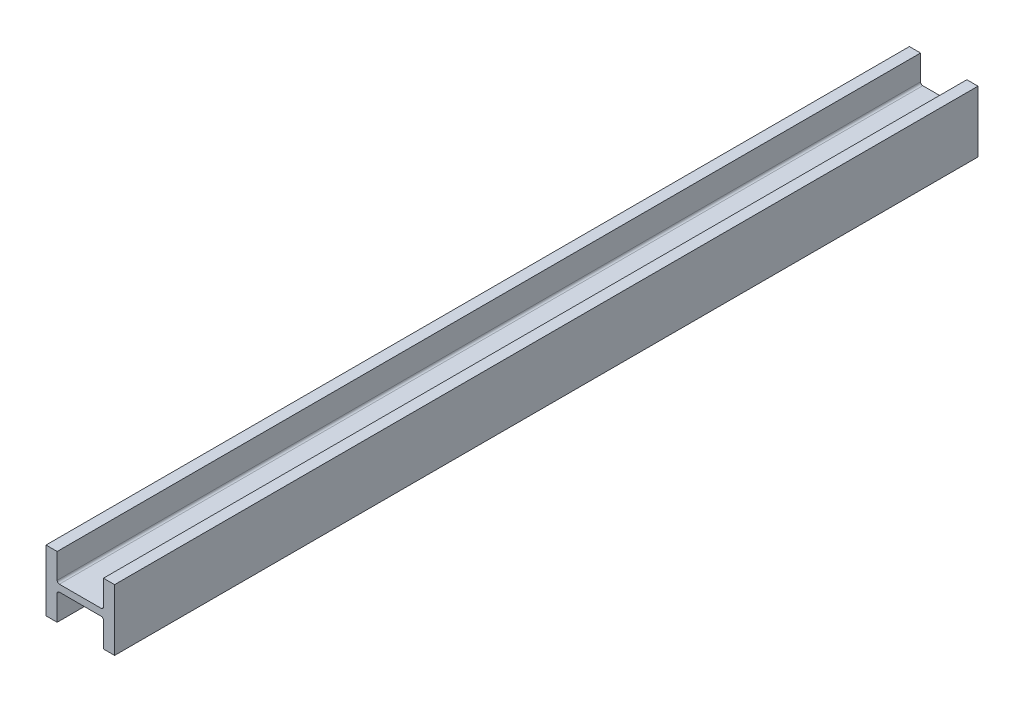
ISO-10303-21;
HEADER;
FILE_DESCRIPTION(('STEP AP214'),'2;1');
FILE_NAME('part.step','',(''),(''),'','','');
FILE_SCHEMA(('AUTOMOTIVE_DESIGN { 1 0 10303 214 1 1 1 1 }'));
ENDSEC;
DATA;
#1=APPLICATION_CONTEXT('core data for automotive mechanical design processes');
#2=APPLICATION_PROTOCOL_DEFINITION('international standard','automotive_design',2000,#1);
#3=PRODUCT_CONTEXT('',#1,'mechanical');
#4=PRODUCT('Part','Part','',(#3));
#5=PRODUCT_RELATED_PRODUCT_CATEGORY('part','',(#4));
#6=PRODUCT_DEFINITION_FORMATION('','',#4);
#7=PRODUCT_DEFINITION_CONTEXT('part definition',#1,'design');
#8=PRODUCT_DEFINITION('design','',#6,#7);
#9=PRODUCT_DEFINITION_SHAPE('','',#8);
#10=(LENGTH_UNIT() NAMED_UNIT(*) SI_UNIT(.MILLI.,.METRE.));
#11=(NAMED_UNIT(*) PLANE_ANGLE_UNIT() SI_UNIT($,.RADIAN.));
#12=(NAMED_UNIT(*) SI_UNIT($,.STERADIAN.) SOLID_ANGLE_UNIT());
#13=UNCERTAINTY_MEASURE_WITH_UNIT(LENGTH_MEASURE(1.E-05),#10,'distance_accuracy_value','');
#14=(GEOMETRIC_REPRESENTATION_CONTEXT(3) GLOBAL_UNCERTAINTY_ASSIGNED_CONTEXT((#13)) GLOBAL_UNIT_ASSIGNED_CONTEXT((#10,
#11,#12)) REPRESENTATION_CONTEXT('',''));
#15=CARTESIAN_POINT('',(0.,0.,0.));
#16=DIRECTION('',(0.,0.,1.));
#17=DIRECTION('',(1.,0.,0.));
#18=AXIS2_PLACEMENT_3D('',#15,#16,#17);
#19=CARTESIAN_POINT('',(237.109,212.0265,2984.5));
#20=DIRECTION('',(-1.,0.,0.));
#21=DIRECTION('',(0.,0.,1.));
#22=AXIS2_PLACEMENT_3D('',#19,#20,#21);
#23=PLANE('',#22);
#24=DIRECTION('',(0.,1.,0.));
#25=VECTOR('',#24,1.);
#26=CARTESIAN_POINT('',(237.109,212.0265,-2984.5));
#27=LINE('',#26,#25);
#28=CARTESIAN_POINT('',(237.109,-212.0265,-2984.5));
#29=VERTEX_POINT('',#28);
#30=CARTESIAN_POINT('',(237.109,212.0265,-2984.5));
#31=VERTEX_POINT('',#30);
#32=EDGE_CURVE('E192',#29,#31,#27,.T.);
#33=ORIENTED_EDGE('',*,*,#32,.T.);
#34=DIRECTION('',(0.,0.,-1.));
#35=VECTOR('',#34,1.);
#36=CARTESIAN_POINT('',(237.109,212.0265,2984.5));
#37=LINE('',#36,#35);
#38=CARTESIAN_POINT('',(237.109,212.0265,2984.5));
#39=VERTEX_POINT('',#38);
#40=EDGE_CURVE('E11',#39,#31,#37,.T.);
#41=ORIENTED_EDGE('',*,*,#40,.F.);
#42=DIRECTION('',(0.,1.,0.));
#43=VECTOR('',#42,1.);
#44=CARTESIAN_POINT('',(237.109,212.0265,2984.5));
#45=LINE('',#44,#43);
#46=CARTESIAN_POINT('',(237.109,-212.0265,2984.5));
#47=VERTEX_POINT('',#46);
#48=EDGE_CURVE('E238',#47,#39,#45,.T.);
#49=ORIENTED_EDGE('',*,*,#48,.F.);
#50=DIRECTION('',(0.,0.,-1.));
#51=VECTOR('',#50,1.);
#52=CARTESIAN_POINT('',(237.109,-212.0265,2984.5));
#53=LINE('',#52,#51);
#54=EDGE_CURVE('E190',#47,#29,#53,.T.);
#55=ORIENTED_EDGE('',*,*,#54,.T.);
#56=EDGE_LOOP('',(#33,#41,#49,#55));
#57=FACE_BOUND('',#56,.T.);
#58=ADVANCED_FACE('F44',(#57),#23,.F.);
#59=CARTESIAN_POINT('',(160.02,212.0265,2984.5));
#60=DIRECTION('',(0.,-1.,0.));
#61=DIRECTION('',(1.,0.,0.));
#62=AXIS2_PLACEMENT_3D('',#59,#60,#61);
#63=PLANE('',#62);
#64=DIRECTION('',(-1.,0.,0.));
#65=VECTOR('',#64,1.);
#66=CARTESIAN_POINT('',(160.02,212.0265,-2984.5));
#67=LINE('',#66,#65);
#68=CARTESIAN_POINT('',(160.02,212.0265,-2984.5));
#69=VERTEX_POINT('',#68);
#70=EDGE_CURVE('E196',#31,#69,#67,.T.);
#71=ORIENTED_EDGE('',*,*,#70,.T.);
#72=DIRECTION('',(0.,0.,-1.));
#73=VECTOR('',#72,1.);
#74=CARTESIAN_POINT('',(160.02,212.0265,2984.5));
#75=LINE('',#74,#73);
#76=CARTESIAN_POINT('',(160.02,212.0265,2984.5));
#77=VERTEX_POINT('',#76);
#78=EDGE_CURVE('E53',#77,#69,#75,.T.);
#79=ORIENTED_EDGE('',*,*,#78,.F.);
#80=DIRECTION('',(-1.,0.,0.));
#81=VECTOR('',#80,1.);
#82=CARTESIAN_POINT('',(160.02,212.0265,2984.5));
#83=LINE('',#82,#81);
#84=EDGE_CURVE('E129',#39,#77,#83,.T.);
#85=ORIENTED_EDGE('',*,*,#84,.F.);
#86=ORIENTED_EDGE('',*,*,#40,.T.);
#87=EDGE_LOOP('',(#71,#79,#85,#86));
#88=FACE_BOUND('',#87,.T.);
#89=ADVANCED_FACE('F362',(#88),#63,.F.);
#90=CARTESIAN_POINT('',(160.02,39.0525000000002,2984.5));
#91=DIRECTION('',(1.,0.,0.));
#92=DIRECTION('',(0.,0.,-1.));
#93=AXIS2_PLACEMENT_3D('',#90,#91,#92);
#94=PLANE('',#93);
#95=DIRECTION('',(0.,-1.,0.));
#96=VECTOR('',#95,1.);
#97=CARTESIAN_POINT('',(160.02,39.0525000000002,-2984.5));
#98=LINE('',#97,#96);
#99=CARTESIAN_POINT('',(160.02,39.0525000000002,-2984.5));
#100=VERTEX_POINT('',#99);
#101=EDGE_CURVE('E203',#69,#100,#98,.T.);
#102=ORIENTED_EDGE('',*,*,#101,.T.);
#103=DIRECTION('',(0.,0.,-1.));
#104=VECTOR('',#103,1.);
#105=CARTESIAN_POINT('',(160.02,39.0525000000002,2984.5));
#106=LINE('',#105,#104);
#107=CARTESIAN_POINT('',(160.02,39.0525000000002,2984.5));
#108=VERTEX_POINT('',#107);
#109=EDGE_CURVE('E284',#108,#100,#106,.T.);
#110=ORIENTED_EDGE('',*,*,#109,.F.);
#111=DIRECTION('',(0.,-1.,0.));
#112=VECTOR('',#111,1.);
#113=CARTESIAN_POINT('',(160.02,39.0525000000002,2984.5));
#114=LINE('',#113,#112);
#115=EDGE_CURVE('E291',#77,#108,#114,.T.);
#116=ORIENTED_EDGE('',*,*,#115,.F.);
#117=ORIENTED_EDGE('',*,*,#78,.T.);
#118=EDGE_LOOP('',(#102,#110,#116,#117));
#119=FACE_BOUND('',#118,.T.);
#120=ADVANCED_FACE('F292',(#119),#94,.F.);
#121=CARTESIAN_POINT('',(144.78,39.0525000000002,2984.5));
#122=DIRECTION('',(0.,0.,-1.));
#123=DIRECTION('',(-1.,0.,0.));
#124=AXIS2_PLACEMENT_3D('',#121,#122,#123);
#125=CYLINDRICAL_SURFACE('',#124,15.24);
#126=CARTESIAN_POINT('',(144.78,39.0525000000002,-2984.5));
#127=DIRECTION('',(0.,0.,-1.));
#128=DIRECTION('',(1.,0.,0.));
#129=AXIS2_PLACEMENT_3D('',#126,#127,#128);
#130=CIRCLE('',#129,15.24);
#131=CARTESIAN_POINT('',(144.78,23.8125000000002,-2984.5));
#132=VERTEX_POINT('',#131);
#133=EDGE_CURVE('E204',#100,#132,#130,.T.);
#134=ORIENTED_EDGE('',*,*,#133,.T.);
#135=DIRECTION('',(0.,0.,-1.));
#136=VECTOR('',#135,1.);
#137=CARTESIAN_POINT('',(144.78,23.8125000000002,2984.5));
#138=LINE('',#137,#136);
#139=CARTESIAN_POINT('',(144.78,23.8125000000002,2984.5));
#140=VERTEX_POINT('',#139);
#141=EDGE_CURVE('E276',#140,#132,#138,.T.);
#142=ORIENTED_EDGE('',*,*,#141,.F.);
#143=CARTESIAN_POINT('',(144.78,39.0525000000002,2984.5));
#144=DIRECTION('',(0.,0.,-1.));
#145=DIRECTION('',(1.,0.,0.));
#146=AXIS2_PLACEMENT_3D('',#143,#144,#145);
#147=CIRCLE('',#146,15.24);
#148=EDGE_CURVE('E315',#108,#140,#147,.T.);
#149=ORIENTED_EDGE('',*,*,#148,.F.);
#150=ORIENTED_EDGE('',*,*,#109,.T.);
#151=EDGE_LOOP('',(#134,#142,#149,#150));
#152=FACE_BOUND('',#151,.T.);
#153=ADVANCED_FACE('F305',(#152),#125,.F.);
#154=CARTESIAN_POINT('',(-144.78,23.8125000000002,2984.5));
#155=DIRECTION('',(0.,-1.,0.));
#156=DIRECTION('',(1.,0.,0.));
#157=AXIS2_PLACEMENT_3D('',#154,#155,#156);
#158=PLANE('',#157);
#159=DIRECTION('',(-1.,0.,0.));
#160=VECTOR('',#159,1.);
#161=CARTESIAN_POINT('',(-144.78,23.8125000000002,-2984.5));
#162=LINE('',#161,#160);
#163=CARTESIAN_POINT('',(-144.78,23.8125000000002,-2984.5));
#164=VERTEX_POINT('',#163);
#165=EDGE_CURVE('E210',#132,#164,#162,.T.);
#166=ORIENTED_EDGE('',*,*,#165,.T.);
#167=DIRECTION('',(0.,0.,-1.));
#168=VECTOR('',#167,1.);
#169=CARTESIAN_POINT('',(-144.78,23.8125000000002,2984.5));
#170=LINE('',#169,#168);
#171=CARTESIAN_POINT('',(-144.78,23.8125000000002,2984.5));
#172=VERTEX_POINT('',#171);
#173=EDGE_CURVE('E274',#172,#164,#170,.T.);
#174=ORIENTED_EDGE('',*,*,#173,.F.);
#175=DIRECTION('',(-1.,0.,0.));
#176=VECTOR('',#175,1.);
#177=CARTESIAN_POINT('',(-144.78,23.8125000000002,2984.5));
#178=LINE('',#177,#176);
#179=EDGE_CURVE('E306',#140,#172,#178,.T.);
#180=ORIENTED_EDGE('',*,*,#179,.F.);
#181=ORIENTED_EDGE('',*,*,#141,.T.);
#182=EDGE_LOOP('',(#166,#174,#180,#181));
#183=FACE_BOUND('',#182,.T.);
#184=ADVANCED_FACE('F308',(#183),#158,.F.);
#185=CARTESIAN_POINT('',(-144.78,39.0525000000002,2984.5));
#186=DIRECTION('',(0.,0.,-1.));
#187=DIRECTION('',(-1.,0.,0.));
#188=AXIS2_PLACEMENT_3D('',#185,#186,#187);
#189=CYLINDRICAL_SURFACE('',#188,15.24);
#190=CARTESIAN_POINT('',(-144.78,39.0525000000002,-2984.5));
#191=DIRECTION('',(0.,0.,-1.));
#192=DIRECTION('',(1.,0.,0.));
#193=AXIS2_PLACEMENT_3D('',#190,#191,#192);
#194=CIRCLE('',#193,15.24);
#195=CARTESIAN_POINT('',(-160.02,39.0525000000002,-2984.5));
#196=VERTEX_POINT('',#195);
#197=EDGE_CURVE('E209',#164,#196,#194,.T.);
#198=ORIENTED_EDGE('',*,*,#197,.T.);
#199=DIRECTION('',(0.,0.,-1.));
#200=VECTOR('',#199,1.);
#201=CARTESIAN_POINT('',(-160.02,39.0525000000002,2984.5));
#202=LINE('',#201,#200);
#203=CARTESIAN_POINT('',(-160.02,39.0525000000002,2984.5));
#204=VERTEX_POINT('',#203);
#205=EDGE_CURVE('E271',#204,#196,#202,.T.);
#206=ORIENTED_EDGE('',*,*,#205,.F.);
#207=CARTESIAN_POINT('',(-144.78,39.0525000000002,2984.5));
#208=DIRECTION('',(0.,0.,-1.));
#209=DIRECTION('',(1.,0.,0.));
#210=AXIS2_PLACEMENT_3D('',#207,#208,#209);
#211=CIRCLE('',#210,15.24);
#212=EDGE_CURVE('E313',#172,#204,#211,.T.);
#213=ORIENTED_EDGE('',*,*,#212,.F.);
#214=ORIENTED_EDGE('',*,*,#173,.T.);
#215=EDGE_LOOP('',(#198,#206,#213,#214));
#216=FACE_BOUND('',#215,.T.);
#217=ADVANCED_FACE('F374',(#216),#189,.F.);
#218=CARTESIAN_POINT('',(-160.02,212.0265,2984.5));
#219=DIRECTION('',(-1.,0.,0.));
#220=DIRECTION('',(0.,0.,1.));
#221=AXIS2_PLACEMENT_3D('',#218,#219,#220);
#222=PLANE('',#221);
#223=DIRECTION('',(0.,1.,0.));
#224=VECTOR('',#223,1.);
#225=CARTESIAN_POINT('',(-160.02,212.0265,-2984.5));
#226=LINE('',#225,#224);
#227=CARTESIAN_POINT('',(-160.02,212.0265,-2984.5));
#228=VERTEX_POINT('',#227);
#229=EDGE_CURVE('E213',#196,#228,#226,.T.);
#230=ORIENTED_EDGE('',*,*,#229,.T.);
#231=DIRECTION('',(0.,0.,-1.));
#232=VECTOR('',#231,1.);
#233=CARTESIAN_POINT('',(-160.02,212.0265,2984.5));
#234=LINE('',#233,#232);
#235=CARTESIAN_POINT('',(-160.02,212.0265,2984.5));
#236=VERTEX_POINT('',#235);
#237=EDGE_CURVE('E270',#236,#228,#234,.T.);
#238=ORIENTED_EDGE('',*,*,#237,.F.);
#239=DIRECTION('',(0.,1.,0.));
#240=VECTOR('',#239,1.);
#241=CARTESIAN_POINT('',(-160.02,212.0265,2984.5));
#242=LINE('',#241,#240);
#243=EDGE_CURVE('E316',#204,#236,#242,.T.);
#244=ORIENTED_EDGE('',*,*,#243,.F.);
#245=ORIENTED_EDGE('',*,*,#205,.T.);
#246=EDGE_LOOP('',(#230,#238,#244,#245));
#247=FACE_BOUND('',#246,.T.);
#248=ADVANCED_FACE('F378',(#247),#222,.F.);
#249=CARTESIAN_POINT('',(-237.109,212.0265,2984.5));
#250=DIRECTION('',(0.,-1.,0.));
#251=DIRECTION('',(0.,0.,-1.));
#252=AXIS2_PLACEMENT_3D('',#249,#250,#251);
#253=PLANE('',#252);
#254=DIRECTION('',(-1.,0.,0.));
#255=VECTOR('',#254,1.);
#256=CARTESIAN_POINT('',(-237.109,212.0265,-2984.5));
#257=LINE('',#256,#255);
#258=CARTESIAN_POINT('',(-237.109,212.0265,-2984.5));
#259=VERTEX_POINT('',#258);
#260=EDGE_CURVE('E216',#228,#259,#257,.T.);
#261=ORIENTED_EDGE('',*,*,#260,.T.);
#262=DIRECTION('',(0.,0.,-1.));
#263=VECTOR('',#262,1.);
#264=CARTESIAN_POINT('',(-237.109,212.0265,2984.5));
#265=LINE('',#264,#263);
#266=CARTESIAN_POINT('',(-237.109,212.0265,2984.5));
#267=VERTEX_POINT('',#266);
#268=EDGE_CURVE('E263',#267,#259,#265,.T.);
#269=ORIENTED_EDGE('',*,*,#268,.F.);
#270=DIRECTION('',(-1.,0.,0.));
#271=VECTOR('',#270,1.);
#272=CARTESIAN_POINT('',(-237.109,212.0265,2984.5));
#273=LINE('',#272,#271);
#274=EDGE_CURVE('E323',#236,#267,#273,.T.);
#275=ORIENTED_EDGE('',*,*,#274,.F.);
#276=ORIENTED_EDGE('',*,*,#237,.T.);
#277=EDGE_LOOP('',(#261,#269,#275,#276));
#278=FACE_BOUND('',#277,.T.);
#279=ADVANCED_FACE('F385',(#278),#253,.F.);
#280=CARTESIAN_POINT('',(-237.109,-212.0265,2984.5));
#281=DIRECTION('',(1.,0.,0.));
#282=DIRECTION('',(0.,0.,-1.));
#283=AXIS2_PLACEMENT_3D('',#280,#281,#282);
#284=PLANE('',#283);
#285=DIRECTION('',(0.,-1.,0.));
#286=VECTOR('',#285,1.);
#287=CARTESIAN_POINT('',(-237.109,-212.0265,-2984.5));
#288=LINE('',#287,#286);
#289=CARTESIAN_POINT('',(-237.109,-212.0265,-2984.5));
#290=VERTEX_POINT('',#289);
#291=EDGE_CURVE('E218',#259,#290,#288,.T.);
#292=ORIENTED_EDGE('',*,*,#291,.T.);
#293=DIRECTION('',(0.,0.,-1.));
#294=VECTOR('',#293,1.);
#295=CARTESIAN_POINT('',(-237.109,-212.0265,2984.5));
#296=LINE('',#295,#294);
#297=CARTESIAN_POINT('',(-237.109,-212.0265,2984.5));
#298=VERTEX_POINT('',#297);
#299=EDGE_CURVE('E259',#298,#290,#296,.T.);
#300=ORIENTED_EDGE('',*,*,#299,.F.);
#301=DIRECTION('',(0.,-1.,0.));
#302=VECTOR('',#301,1.);
#303=CARTESIAN_POINT('',(-237.109,-212.0265,2984.5));
#304=LINE('',#303,#302);
#305=EDGE_CURVE('E326',#267,#298,#304,.T.);
#306=ORIENTED_EDGE('',*,*,#305,.F.);
#307=ORIENTED_EDGE('',*,*,#268,.T.);
#308=EDGE_LOOP('',(#292,#300,#306,#307));
#309=FACE_BOUND('',#308,.T.);
#310=ADVANCED_FACE('F387',(#309),#284,.F.);
#311=CARTESIAN_POINT('',(-160.02,-212.0265,2984.5));
#312=DIRECTION('',(0.,1.,0.));
#313=DIRECTION('',(0.,0.,1.));
#314=AXIS2_PLACEMENT_3D('',#311,#312,#313);
#315=PLANE('',#314);
#316=DIRECTION('',(1.,0.,0.));
#317=VECTOR('',#316,1.);
#318=CARTESIAN_POINT('',(-160.02,-212.0265,-2984.5));
#319=LINE('',#318,#317);
#320=CARTESIAN_POINT('',(-160.02,-212.0265,-2984.5));
#321=VERTEX_POINT('',#320);
#322=EDGE_CURVE('E225',#290,#321,#319,.T.);
#323=ORIENTED_EDGE('',*,*,#322,.T.);
#324=DIRECTION('',(0.,0.,-1.));
#325=VECTOR('',#324,1.);
#326=CARTESIAN_POINT('',(-160.02,-212.0265,2984.5));
#327=LINE('',#326,#325);
#328=CARTESIAN_POINT('',(-160.02,-212.0265,2984.5));
#329=VERTEX_POINT('',#328);
#330=EDGE_CURVE('E254',#329,#321,#327,.T.);
#331=ORIENTED_EDGE('',*,*,#330,.F.);
#332=DIRECTION('',(1.,0.,0.));
#333=VECTOR('',#332,1.);
#334=CARTESIAN_POINT('',(-160.02,-212.0265,2984.5));
#335=LINE('',#334,#333);
#336=EDGE_CURVE('E328',#298,#329,#335,.T.);
#337=ORIENTED_EDGE('',*,*,#336,.F.);
#338=ORIENTED_EDGE('',*,*,#299,.T.);
#339=EDGE_LOOP('',(#323,#331,#337,#338));
#340=FACE_BOUND('',#339,.T.);
#341=ADVANCED_FACE('F388',(#340),#315,.F.);
#342=CARTESIAN_POINT('',(-160.02,-39.0524999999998,2984.5));
#343=DIRECTION('',(-1.,0.,0.));
#344=DIRECTION('',(0.,0.,1.));
#345=AXIS2_PLACEMENT_3D('',#342,#343,#344);
#346=PLANE('',#345);
#347=DIRECTION('',(0.,1.,0.));
#348=VECTOR('',#347,1.);
#349=CARTESIAN_POINT('',(-160.02,-39.0524999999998,-2984.5));
#350=LINE('',#349,#348);
#351=CARTESIAN_POINT('',(-160.02,-39.0524999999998,-2984.5));
#352=VERTEX_POINT('',#351);
#353=EDGE_CURVE('E223',#321,#352,#350,.T.);
#354=ORIENTED_EDGE('',*,*,#353,.T.);
#355=DIRECTION('',(0.,0.,-1.));
#356=VECTOR('',#355,1.);
#357=CARTESIAN_POINT('',(-160.02,-39.0524999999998,2984.5));
#358=LINE('',#357,#356);
#359=CARTESIAN_POINT('',(-160.02,-39.0524999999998,2984.5));
#360=VERTEX_POINT('',#359);
#361=EDGE_CURVE('E253',#360,#352,#358,.T.);
#362=ORIENTED_EDGE('',*,*,#361,.F.);
#363=DIRECTION('',(0.,1.,0.));
#364=VECTOR('',#363,1.);
#365=CARTESIAN_POINT('',(-160.02,-39.0524999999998,2984.5));
#366=LINE('',#365,#364);
#367=EDGE_CURVE('E335',#329,#360,#366,.T.);
#368=ORIENTED_EDGE('',*,*,#367,.F.);
#369=ORIENTED_EDGE('',*,*,#330,.T.);
#370=EDGE_LOOP('',(#354,#362,#368,#369));
#371=FACE_BOUND('',#370,.T.);
#372=ADVANCED_FACE('F393',(#371),#346,.F.);
#373=CARTESIAN_POINT('',(-144.78,-39.0524999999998,2984.5));
#374=DIRECTION('',(0.,0.,-1.));
#375=DIRECTION('',(-1.,0.,0.));
#376=AXIS2_PLACEMENT_3D('',#373,#374,#375);
#377=CYLINDRICAL_SURFACE('',#376,15.24);
#378=CARTESIAN_POINT('',(-144.78,-39.0524999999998,-2984.5));
#379=DIRECTION('',(0.,0.,-1.));
#380=DIRECTION('',(1.,0.,0.));
#381=AXIS2_PLACEMENT_3D('',#378,#379,#380);
#382=CIRCLE('',#381,15.24);
#383=CARTESIAN_POINT('',(-144.78,-23.8124999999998,-2984.5));
#384=VERTEX_POINT('',#383);
#385=EDGE_CURVE('E229',#352,#384,#382,.T.);
#386=ORIENTED_EDGE('',*,*,#385,.T.);
#387=DIRECTION('',(0.,0.,-1.));
#388=VECTOR('',#387,1.);
#389=CARTESIAN_POINT('',(-144.78,-23.8124999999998,2984.5));
#390=LINE('',#389,#388);
#391=CARTESIAN_POINT('',(-144.78,-23.8124999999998,2984.5));
#392=VERTEX_POINT('',#391);
#393=EDGE_CURVE('E250',#392,#384,#390,.T.);
#394=ORIENTED_EDGE('',*,*,#393,.F.);
#395=CARTESIAN_POINT('',(-144.78,-39.0524999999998,2984.5));
#396=DIRECTION('',(0.,0.,-1.));
#397=DIRECTION('',(1.,0.,0.));
#398=AXIS2_PLACEMENT_3D('',#395,#396,#397);
#399=CIRCLE('',#398,15.24);
#400=EDGE_CURVE('E333',#360,#392,#399,.T.);
#401=ORIENTED_EDGE('',*,*,#400,.F.);
#402=ORIENTED_EDGE('',*,*,#361,.T.);
#403=EDGE_LOOP('',(#386,#394,#401,#402));
#404=FACE_BOUND('',#403,.T.);
#405=ADVANCED_FACE('F343',(#404),#377,.F.);
#406=CARTESIAN_POINT('',(144.78,-23.8124999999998,2984.5));
#407=DIRECTION('',(0.,1.,0.));
#408=DIRECTION('',(-1.,0.,0.));
#409=AXIS2_PLACEMENT_3D('',#406,#407,#408);
#410=PLANE('',#409);
#411=DIRECTION('',(1.,0.,0.));
#412=VECTOR('',#411,1.);
#413=CARTESIAN_POINT('',(144.78,-23.8124999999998,-2984.5));
#414=LINE('',#413,#412);
#415=CARTESIAN_POINT('',(144.78,-23.8124999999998,-2984.5));
#416=VERTEX_POINT('',#415);
#417=EDGE_CURVE('E231',#384,#416,#414,.T.);
#418=ORIENTED_EDGE('',*,*,#417,.T.);
#419=DIRECTION('',(0.,0.,-1.));
#420=VECTOR('',#419,1.);
#421=CARTESIAN_POINT('',(144.78,-23.8124999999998,2984.5));
#422=LINE('',#421,#420);
#423=CARTESIAN_POINT('',(144.78,-23.8124999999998,2984.5));
#424=VERTEX_POINT('',#423);
#425=EDGE_CURVE('E181',#424,#416,#422,.T.);
#426=ORIENTED_EDGE('',*,*,#425,.F.);
#427=DIRECTION('',(1.,0.,0.));
#428=VECTOR('',#427,1.);
#429=CARTESIAN_POINT('',(144.78,-23.8124999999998,2984.5));
#430=LINE('',#429,#428);
#431=EDGE_CURVE('E172',#392,#424,#430,.T.);
#432=ORIENTED_EDGE('',*,*,#431,.F.);
#433=ORIENTED_EDGE('',*,*,#393,.T.);
#434=EDGE_LOOP('',(#418,#426,#432,#433));
#435=FACE_BOUND('',#434,.T.);
#436=ADVANCED_FACE('F350',(#435),#410,.F.);
#437=CARTESIAN_POINT('',(144.78,-39.0524999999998,2984.5));
#438=DIRECTION('',(0.,0.,-1.));
#439=DIRECTION('',(-1.,0.,0.));
#440=AXIS2_PLACEMENT_3D('',#437,#438,#439);
#441=CYLINDRICAL_SURFACE('',#440,15.24);
#442=CARTESIAN_POINT('',(144.78,-39.0524999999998,-2984.5));
#443=DIRECTION('',(0.,0.,-1.));
#444=DIRECTION('',(1.,0.,0.));
#445=AXIS2_PLACEMENT_3D('',#442,#443,#444);
#446=CIRCLE('',#445,15.24);
#447=CARTESIAN_POINT('',(160.02,-39.0524999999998,-2984.5));
#448=VERTEX_POINT('',#447);
#449=EDGE_CURVE('E182',#416,#448,#446,.T.);
#450=ORIENTED_EDGE('',*,*,#449,.T.);
#451=DIRECTION('',(0.,0.,-1.));
#452=VECTOR('',#451,1.);
#453=CARTESIAN_POINT('',(160.02,-39.0524999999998,2984.5));
#454=LINE('',#453,#452);
#455=CARTESIAN_POINT('',(160.02,-39.0524999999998,2984.5));
#456=VERTEX_POINT('',#455);
#457=EDGE_CURVE('E178',#456,#448,#454,.T.);
#458=ORIENTED_EDGE('',*,*,#457,.F.);
#459=CARTESIAN_POINT('',(144.78,-39.0524999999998,2984.5));
#460=DIRECTION('',(0.,0.,-1.));
#461=DIRECTION('',(1.,0.,0.));
#462=AXIS2_PLACEMENT_3D('',#459,#460,#461);
#463=CIRCLE('',#462,15.24);
#464=EDGE_CURVE('E167',#424,#456,#463,.T.);
#465=ORIENTED_EDGE('',*,*,#464,.F.);
#466=ORIENTED_EDGE('',*,*,#425,.T.);
#467=EDGE_LOOP('',(#450,#458,#465,#466));
#468=FACE_BOUND('',#467,.T.);
#469=ADVANCED_FACE('F177',(#468),#441,.F.);
#470=CARTESIAN_POINT('',(160.02,-212.0265,2984.5));
#471=DIRECTION('',(1.,0.,0.));
#472=DIRECTION('',(0.,0.,-1.));
#473=AXIS2_PLACEMENT_3D('',#470,#471,#472);
#474=PLANE('',#473);
#475=DIRECTION('',(0.,-1.,0.));
#476=VECTOR('',#475,1.);
#477=CARTESIAN_POINT('',(160.02,-212.0265,-2984.5));
#478=LINE('',#477,#476);
#479=CARTESIAN_POINT('',(160.02,-212.0265,-2984.5));
#480=VERTEX_POINT('',#479);
#481=EDGE_CURVE('E113',#448,#480,#478,.T.);
#482=ORIENTED_EDGE('',*,*,#481,.T.);
#483=DIRECTION('',(0.,0.,-1.));
#484=VECTOR('',#483,1.);
#485=CARTESIAN_POINT('',(160.02,-212.0265,2984.5));
#486=LINE('',#485,#484);
#487=CARTESIAN_POINT('',(160.02,-212.0265,2984.5));
#488=VERTEX_POINT('',#487);
#489=EDGE_CURVE('E184',#488,#480,#486,.T.);
#490=ORIENTED_EDGE('',*,*,#489,.F.);
#491=DIRECTION('',(0.,-1.,0.));
#492=VECTOR('',#491,1.);
#493=CARTESIAN_POINT('',(160.02,-212.0265,2984.5));
#494=LINE('',#493,#492);
#495=EDGE_CURVE('E168',#456,#488,#494,.T.);
#496=ORIENTED_EDGE('',*,*,#495,.F.);
#497=ORIENTED_EDGE('',*,*,#457,.T.);
#498=EDGE_LOOP('',(#482,#490,#496,#497));
#499=FACE_BOUND('',#498,.T.);
#500=ADVANCED_FACE('F186',(#499),#474,.F.);
#501=CARTESIAN_POINT('',(237.109,-212.0265,2984.5));
#502=DIRECTION('',(0.,1.,0.));
#503=DIRECTION('',(-1.,0.,0.));
#504=AXIS2_PLACEMENT_3D('',#501,#502,#503);
#505=PLANE('',#504);
#506=DIRECTION('',(1.,0.,0.));
#507=VECTOR('',#506,1.);
#508=CARTESIAN_POINT('',(237.109,-212.0265,-2984.5));
#509=LINE('',#508,#507);
#510=EDGE_CURVE('E121',#480,#29,#509,.T.);
#511=ORIENTED_EDGE('',*,*,#510,.T.);
#512=ORIENTED_EDGE('',*,*,#54,.F.);
#513=DIRECTION('',(1.,0.,0.));
#514=VECTOR('',#513,1.);
#515=CARTESIAN_POINT('',(237.109,-212.0265,2984.5));
#516=LINE('',#515,#514);
#517=EDGE_CURVE('E62',#488,#47,#516,.T.);
#518=ORIENTED_EDGE('',*,*,#517,.F.);
#519=ORIENTED_EDGE('',*,*,#489,.T.);
#520=EDGE_LOOP('',(#511,#512,#518,#519));
#521=FACE_BOUND('',#520,.T.);
#522=ADVANCED_FACE('F351',(#521),#505,.F.);
#523=CARTESIAN_POINT('',(144.78,-39.0524999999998,2984.5));
#524=DIRECTION('',(0.,0.,1.));
#525=DIRECTION('',(1.,0.,0.));
#526=AXIS2_PLACEMENT_3D('',#523,#524,#525);
#527=PLANE('',#526);
#528=ORIENTED_EDGE('',*,*,#48,.T.);
#529=ORIENTED_EDGE('',*,*,#84,.T.);
#530=ORIENTED_EDGE('',*,*,#115,.T.);
#531=ORIENTED_EDGE('',*,*,#148,.T.);
#532=ORIENTED_EDGE('',*,*,#179,.T.);
#533=ORIENTED_EDGE('',*,*,#212,.T.);
#534=ORIENTED_EDGE('',*,*,#243,.T.);
#535=ORIENTED_EDGE('',*,*,#274,.T.);
#536=ORIENTED_EDGE('',*,*,#305,.T.);
#537=ORIENTED_EDGE('',*,*,#336,.T.);
#538=ORIENTED_EDGE('',*,*,#367,.T.);
#539=ORIENTED_EDGE('',*,*,#400,.T.);
#540=ORIENTED_EDGE('',*,*,#431,.T.);
#541=ORIENTED_EDGE('',*,*,#464,.T.);
#542=ORIENTED_EDGE('',*,*,#495,.T.);
#543=ORIENTED_EDGE('',*,*,#517,.T.);
#544=EDGE_LOOP('',(#528,#529,#530,#531,#532,#533,#534,#535,#536,#537,#538,#539,#540,#541,#542,#543));
#545=FACE_BOUND('',#544,.T.);
#546=ADVANCED_FACE('F169',(#545),#527,.T.);
#547=CARTESIAN_POINT('',(144.78,-39.0524999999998,-2984.5));
#548=DIRECTION('',(0.,0.,1.));
#549=DIRECTION('',(1.,0.,0.));
#550=AXIS2_PLACEMENT_3D('',#547,#548,#549);
#551=PLANE('',#550);
#552=ORIENTED_EDGE('',*,*,#32,.F.);
#553=ORIENTED_EDGE('',*,*,#510,.F.);
#554=ORIENTED_EDGE('',*,*,#481,.F.);
#555=ORIENTED_EDGE('',*,*,#449,.F.);
#556=ORIENTED_EDGE('',*,*,#417,.F.);
#557=ORIENTED_EDGE('',*,*,#385,.F.);
#558=ORIENTED_EDGE('',*,*,#353,.F.);
#559=ORIENTED_EDGE('',*,*,#322,.F.);
#560=ORIENTED_EDGE('',*,*,#291,.F.);
#561=ORIENTED_EDGE('',*,*,#260,.F.);
#562=ORIENTED_EDGE('',*,*,#229,.F.);
#563=ORIENTED_EDGE('',*,*,#197,.F.);
#564=ORIENTED_EDGE('',*,*,#165,.F.);
#565=ORIENTED_EDGE('',*,*,#133,.F.);
#566=ORIENTED_EDGE('',*,*,#101,.F.);
#567=ORIENTED_EDGE('',*,*,#70,.F.);
#568=EDGE_LOOP('',(#552,#553,#554,#555,#556,#557,#558,#559,#560,#561,#562,#563,#564,#565,#566,#567));
#569=FACE_BOUND('',#568,.T.);
#570=ADVANCED_FACE('F297',(#569),#551,.F.);
#571=CLOSED_SHELL('',(#58,#89,#120,#153,#184,#217,#248,#279,#310,#341,#372,#405,#436,#469,#500,
#522,#546,#570));
#572=MANIFOLD_SOLID_BREP('B2',#571);
#573=ADVANCED_BREP_SHAPE_REPRESENTATION('',(#18,#572),#14);
#574=SHAPE_DEFINITION_REPRESENTATION(#9,#573);
ENDSEC;
END-ISO-10303-21;
